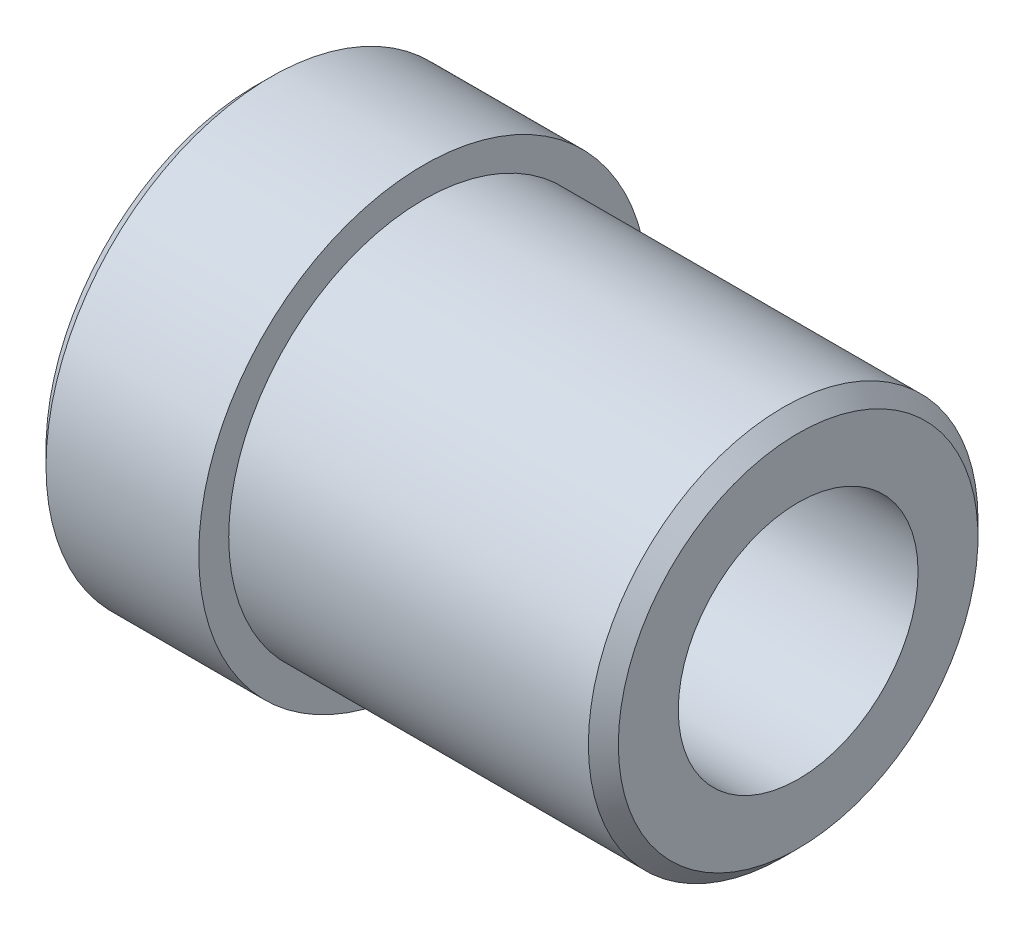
ISO-10303-21;
HEADER;
FILE_DESCRIPTION(('STEP AP214'),'2;1');
FILE_NAME('part.step','',(''),(''),'','','');
FILE_SCHEMA(('AUTOMOTIVE_DESIGN { 1 0 10303 214 1 1 1 1 }'));
ENDSEC;
DATA;
#1=APPLICATION_CONTEXT('core data for automotive mechanical design processes');
#2=APPLICATION_PROTOCOL_DEFINITION('international standard','automotive_design',2000,#1);
#3=PRODUCT_CONTEXT('',#1,'mechanical');
#4=PRODUCT('Part','Part','',(#3));
#5=PRODUCT_RELATED_PRODUCT_CATEGORY('part','',(#4));
#6=PRODUCT_DEFINITION_FORMATION('','',#4);
#7=PRODUCT_DEFINITION_CONTEXT('part definition',#1,'design');
#8=PRODUCT_DEFINITION('design','',#6,#7);
#9=PRODUCT_DEFINITION_SHAPE('','',#8);
#10=(LENGTH_UNIT() NAMED_UNIT(*) SI_UNIT(.MILLI.,.METRE.));
#11=(NAMED_UNIT(*) PLANE_ANGLE_UNIT() SI_UNIT($,.RADIAN.));
#12=(NAMED_UNIT(*) SI_UNIT($,.STERADIAN.) SOLID_ANGLE_UNIT());
#13=UNCERTAINTY_MEASURE_WITH_UNIT(LENGTH_MEASURE(1.E-05),#10,'distance_accuracy_value','');
#14=(GEOMETRIC_REPRESENTATION_CONTEXT(3) GLOBAL_UNCERTAINTY_ASSIGNED_CONTEXT((#13)) GLOBAL_UNIT_ASSIGNED_CONTEXT((#10,
#11,#12)) REPRESENTATION_CONTEXT('',''));
#15=CARTESIAN_POINT('',(0.,0.,0.));
#16=DIRECTION('',(0.,0.,1.));
#17=DIRECTION('',(1.,0.,0.));
#18=AXIS2_PLACEMENT_3D('',#15,#16,#17);
#19=CARTESIAN_POINT('',(0.,15.,0.));
#20=DIRECTION('',(1.,0.,0.));
#21=DIRECTION('',(0.,0.,-1.));
#22=AXIS2_PLACEMENT_3D('',#19,#20,#21);
#23=PLANE('',#22);
#24=CARTESIAN_POINT('',(0.,0.,0.));
#25=DIRECTION('',(1.,0.,0.));
#26=DIRECTION('',(0.,0.,-1.));
#27=AXIS2_PLACEMENT_3D('',#24,#25,#26);
#28=CIRCLE('',#27,14.);
#29=CARTESIAN_POINT('',(0.,0.,-14.));
#30=VERTEX_POINT('',#29);
#31=EDGE_CURVE('E44',#30,#30,#28,.F.);
#32=ORIENTED_EDGE('',*,*,#31,.T.);
#33=EDGE_LOOP('',(#32));
#34=FACE_BOUND('',#33,.T.);
#35=CARTESIAN_POINT('',(0.,0.,0.));
#36=DIRECTION('',(-1.,0.,0.));
#37=DIRECTION('',(0.,0.,1.));
#38=AXIS2_PLACEMENT_3D('',#35,#36,#37);
#39=CIRCLE('',#38,8.);
#40=CARTESIAN_POINT('',(0.,0.,8.));
#41=VERTEX_POINT('',#40);
#42=EDGE_CURVE('E58',#41,#41,#39,.T.);
#43=ORIENTED_EDGE('',*,*,#42,.F.);
#44=EDGE_LOOP('',(#43));
#45=FACE_BOUND('',#44,.T.);
#46=ADVANCED_FACE('F30',(#34,#45),#23,.F.);
#47=CARTESIAN_POINT('',(0.,0.,0.));
#48=DIRECTION('',(-1.,0.,0.));
#49=DIRECTION('',(0.,0.,1.));
#50=AXIS2_PLACEMENT_3D('',#47,#48,#49);
#51=CYLINDRICAL_SURFACE('',#50,15.);
#52=CARTESIAN_POINT('',(1.00000000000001,0.,0.));
#53=DIRECTION('',(1.,0.,0.));
#54=DIRECTION('',(0.,0.,-1.));
#55=AXIS2_PLACEMENT_3D('',#52,#53,#54);
#56=CIRCLE('',#55,15.);
#57=CARTESIAN_POINT('',(1.00000000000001,0.,-15.));
#58=VERTEX_POINT('',#57);
#59=EDGE_CURVE('E40',#58,#58,#56,.T.);
#60=ORIENTED_EDGE('',*,*,#59,.T.);
#61=EDGE_LOOP('',(#60));
#62=FACE_BOUND('',#61,.T.);
#63=CARTESIAN_POINT('',(11.1929723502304,0.,0.));
#64=DIRECTION('',(-1.,0.,0.));
#65=DIRECTION('',(0.,0.,1.));
#66=AXIS2_PLACEMENT_3D('',#63,#64,#65);
#67=CIRCLE('',#66,15.);
#68=CARTESIAN_POINT('',(11.1929723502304,0.,15.));
#69=VERTEX_POINT('',#68);
#70=EDGE_CURVE('E49',#69,#69,#67,.T.);
#71=ORIENTED_EDGE('',*,*,#70,.T.);
#72=EDGE_LOOP('',(#71));
#73=FACE_BOUND('',#72,.T.);
#74=ADVANCED_FACE('F65',(#62,#73),#51,.T.);
#75=CARTESIAN_POINT('',(11.1929723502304,13.,0.));
#76=DIRECTION('',(-1.,0.,0.));
#77=DIRECTION('',(0.,0.,1.));
#78=AXIS2_PLACEMENT_3D('',#75,#76,#77);
#79=PLANE('',#78);
#80=ORIENTED_EDGE('',*,*,#70,.F.);
#81=EDGE_LOOP('',(#80));
#82=FACE_BOUND('',#81,.T.);
#83=CARTESIAN_POINT('',(11.1929723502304,0.,0.));
#84=DIRECTION('',(-1.,0.,0.));
#85=DIRECTION('',(0.,0.,1.));
#86=AXIS2_PLACEMENT_3D('',#83,#84,#85);
#87=CIRCLE('',#86,13.);
#88=CARTESIAN_POINT('',(11.1929723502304,0.,13.));
#89=VERTEX_POINT('',#88);
#90=EDGE_CURVE('E52',#89,#89,#87,.T.);
#91=ORIENTED_EDGE('',*,*,#90,.T.);
#92=EDGE_LOOP('',(#91));
#93=FACE_BOUND('',#92,.T.);
#94=ADVANCED_FACE('F70',(#82,#93),#79,.F.);
#95=CARTESIAN_POINT('',(0.,0.,0.));
#96=DIRECTION('',(-1.,0.,0.));
#97=DIRECTION('',(0.,0.,1.));
#98=AXIS2_PLACEMENT_3D('',#95,#96,#97);
#99=CYLINDRICAL_SURFACE('',#98,13.);
#100=CARTESIAN_POINT('',(35.1929723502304,0.,0.));
#101=DIRECTION('',(-1.,0.,0.));
#102=DIRECTION('',(0.,0.,1.));
#103=AXIS2_PLACEMENT_3D('',#100,#101,#102);
#104=CIRCLE('',#103,13.);
#105=CARTESIAN_POINT('',(35.1929723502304,0.,13.));
#106=VERTEX_POINT('',#105);
#107=EDGE_CURVE('E36',#106,#106,#104,.T.);
#108=ORIENTED_EDGE('',*,*,#107,.T.);
#109=EDGE_LOOP('',(#108));
#110=FACE_BOUND('',#109,.T.);
#111=ORIENTED_EDGE('',*,*,#90,.F.);
#112=EDGE_LOOP('',(#111));
#113=FACE_BOUND('',#112,.T.);
#114=ADVANCED_FACE('F92',(#110,#113),#99,.T.);
#115=CARTESIAN_POINT('',(36.1929723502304,8.,0.));
#116=DIRECTION('',(-1.,0.,0.));
#117=DIRECTION('',(0.,0.,1.));
#118=AXIS2_PLACEMENT_3D('',#115,#116,#117);
#119=PLANE('',#118);
#120=CARTESIAN_POINT('',(36.1929723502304,0.,0.));
#121=DIRECTION('',(-1.,0.,0.));
#122=DIRECTION('',(0.,0.,1.));
#123=AXIS2_PLACEMENT_3D('',#120,#121,#122);
#124=CIRCLE('',#123,12.);
#125=CARTESIAN_POINT('',(36.1929723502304,0.,12.));
#126=VERTEX_POINT('',#125);
#127=EDGE_CURVE('E10',#126,#126,#124,.F.);
#128=ORIENTED_EDGE('',*,*,#127,.T.);
#129=EDGE_LOOP('',(#128));
#130=FACE_BOUND('',#129,.T.);
#131=CARTESIAN_POINT('',(36.1929723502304,0.,0.));
#132=DIRECTION('',(-1.,0.,0.));
#133=DIRECTION('',(0.,0.,1.));
#134=AXIS2_PLACEMENT_3D('',#131,#132,#133);
#135=CIRCLE('',#134,8.);
#136=CARTESIAN_POINT('',(36.1929723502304,0.,8.));
#137=VERTEX_POINT('',#136);
#138=EDGE_CURVE('E55',#137,#137,#135,.T.);
#139=ORIENTED_EDGE('',*,*,#138,.T.);
#140=EDGE_LOOP('',(#139));
#141=FACE_BOUND('',#140,.T.);
#142=ADVANCED_FACE('F85',(#130,#141),#119,.F.);
#143=CARTESIAN_POINT('',(0.,0.,0.));
#144=DIRECTION('',(-1.,0.,0.));
#145=DIRECTION('',(0.,0.,1.));
#146=AXIS2_PLACEMENT_3D('',#143,#144,#145);
#147=CYLINDRICAL_SURFACE('',#146,8.);
#148=ORIENTED_EDGE('',*,*,#138,.F.);
#149=EDGE_LOOP('',(#148));
#150=FACE_BOUND('',#149,.T.);
#151=ORIENTED_EDGE('',*,*,#42,.T.);
#152=EDGE_LOOP('',(#151));
#153=FACE_BOUND('',#152,.T.);
#154=ADVANCED_FACE('F62',(#150,#153),#147,.F.);
#155=CARTESIAN_POINT('',(0.,0.,0.));
#156=DIRECTION('',(1.,0.,0.));
#157=DIRECTION('',(0.,0.,-1.));
#158=AXIS2_PLACEMENT_3D('',#155,#156,#157);
#159=CONICAL_SURFACE('',#158,14.,0.785398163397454);
#160=ORIENTED_EDGE('',*,*,#59,.F.);
#161=EDGE_LOOP('',(#160));
#162=FACE_BOUND('',#161,.T.);
#163=ORIENTED_EDGE('',*,*,#31,.F.);
#164=EDGE_LOOP('',(#163));
#165=FACE_BOUND('',#164,.T.);
#166=ADVANCED_FACE('F74',(#162,#165),#159,.T.);
#167=CARTESIAN_POINT('',(35.1929723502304,0.,0.));
#168=DIRECTION('',(-1.,0.,0.));
#169=DIRECTION('',(0.,0.,1.));
#170=AXIS2_PLACEMENT_3D('',#167,#168,#169);
#171=CONICAL_SURFACE('',#170,13.,0.785398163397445);
#172=ORIENTED_EDGE('',*,*,#127,.F.);
#173=EDGE_LOOP('',(#172));
#174=FACE_BOUND('',#173,.T.);
#175=ORIENTED_EDGE('',*,*,#107,.F.);
#176=EDGE_LOOP('',(#175));
#177=FACE_BOUND('',#176,.T.);
#178=ADVANCED_FACE('F76',(#174,#177),#171,.T.);
#179=CLOSED_SHELL('',(#46,#74,#94,#114,#142,#154,#166,#178));
#180=MANIFOLD_SOLID_BREP('B2',#179);
#181=ADVANCED_BREP_SHAPE_REPRESENTATION('',(#18,#180),#14);
#182=SHAPE_DEFINITION_REPRESENTATION(#9,#181);
ENDSEC;
END-ISO-10303-21;
